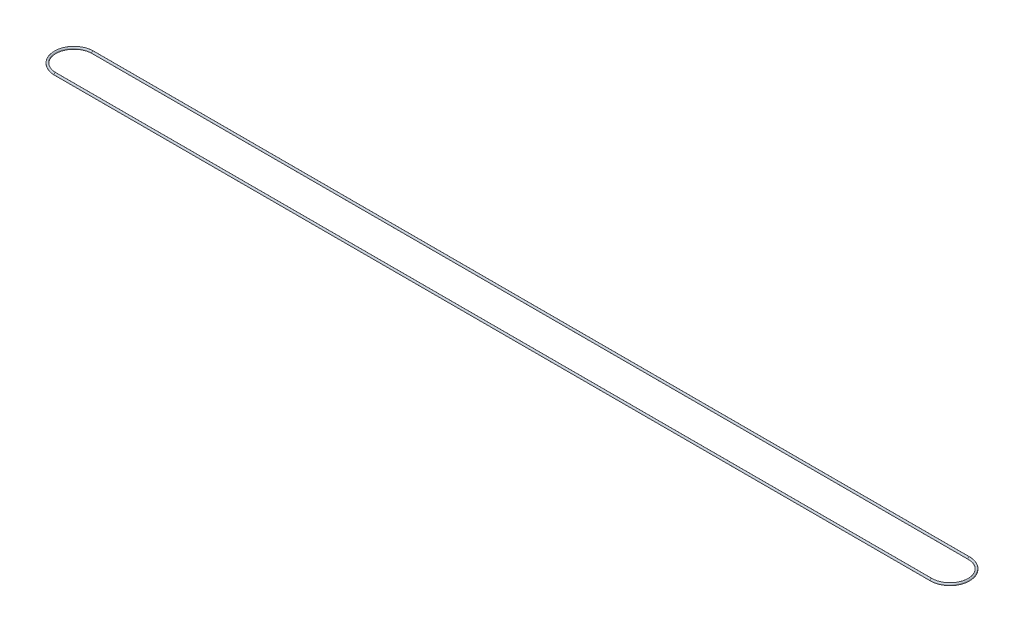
from build123d import *

# Parameters (mm, degrees)
SKETCH2_R = 3.175


with BuildPart() as part:
    # Sweep1: sweep along a path in Sketch1
    with BuildLine(Plane(origin=(0, 0, 0), x_dir=(1, 0, 0), z_dir=(0, 1, 0))) as sweep1_path:
        Line((-1333.5, 57.15), (1333.5, 57.15))
        ThreePointArc((1333.5, 57.15), (1390.65, 0), (1333.5, -57.15))
        Line((1333.5, -57.15), (-1333.5, -57.15))
        ThreePointArc((-1333.5, -57.15), (-1390.65, 0), (-1333.5, 57.15))
    # Sketch2 → Sweep1 (sweep)
    with BuildSketch(Plane(origin=(0, 0, 0), x_dir=(0, 0, -1), z_dir=(1, 0, 0))):
        with Locations((57.15, 0)):
            Circle(SKETCH2_R)
    sweep(path=sweep1_path.line)


solid = part.part
